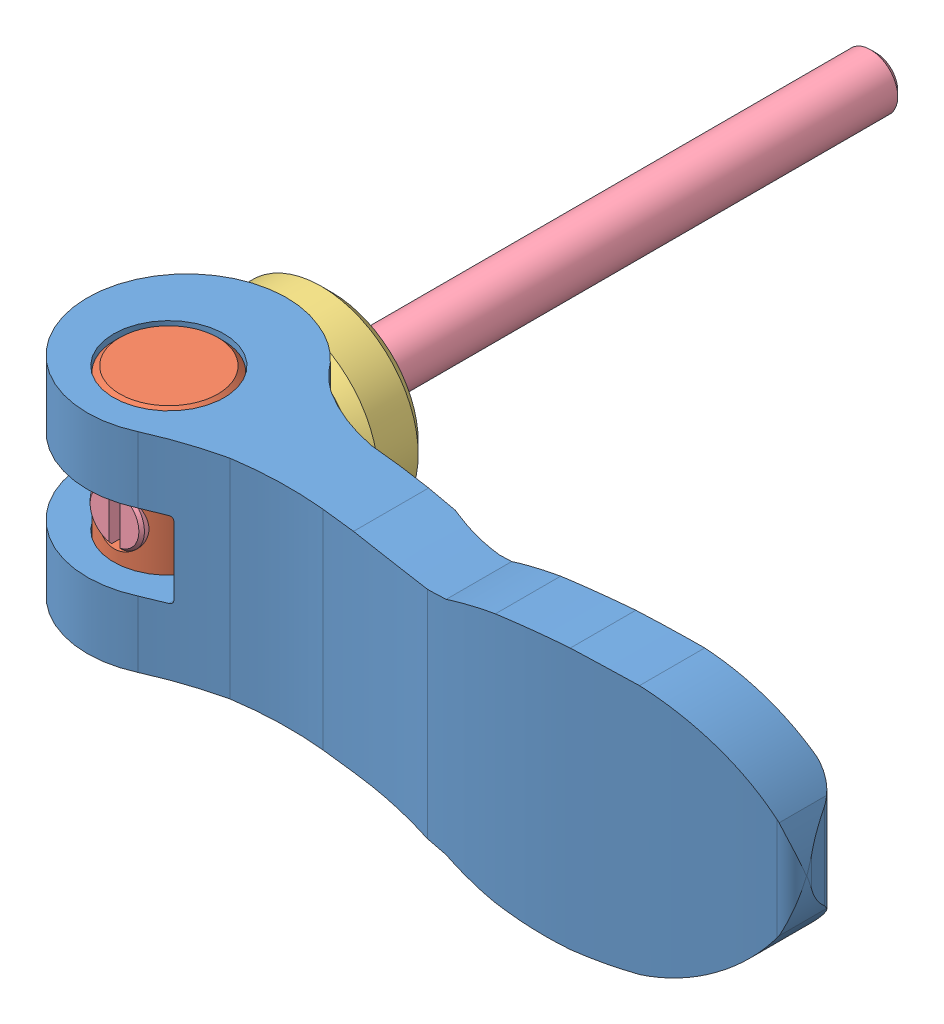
SolidWorks assembly KCL03X30-SUS.SLDASM, configuration Default (file format 15000). Lengths in mm.
Overall size (41.7 14.48 43.5).
4 component instances, 4 part files, 0 mates.
Components (placement in the parent):
- KCL03X30-SUS_01-1: KCL03X30-SUS_01.SLDPRT [ﾃﾞﾌｫﾙﾄ] at (0 0 9) x (1 0 0) z (0 -1 0) size (41.7 11 14.48)
- KCL03X30-SUS_02-1: KCL03X30-SUS_02.SLDPRT [ﾃﾞﾌｫﾙﾄ] at (0 0 9) x (0 1 0) z (1 0 0) size (11.5 6 6)
- KCL03X30-SUS_03-1: KCL03X30-SUS_03.SLDPRT [ﾃﾞﾌｫﾙﾄ] x (1 0 0) z (0 -1 0) size (10.7 3.73 10.7)
- KCL03X30-SUS_04-1: KCL03X30-SUS_04.SLDPRT [ﾃﾞﾌｫﾙﾄ] at (0 0 -10) x (0 1 0) z (1 0 0) size (3 42 3)
